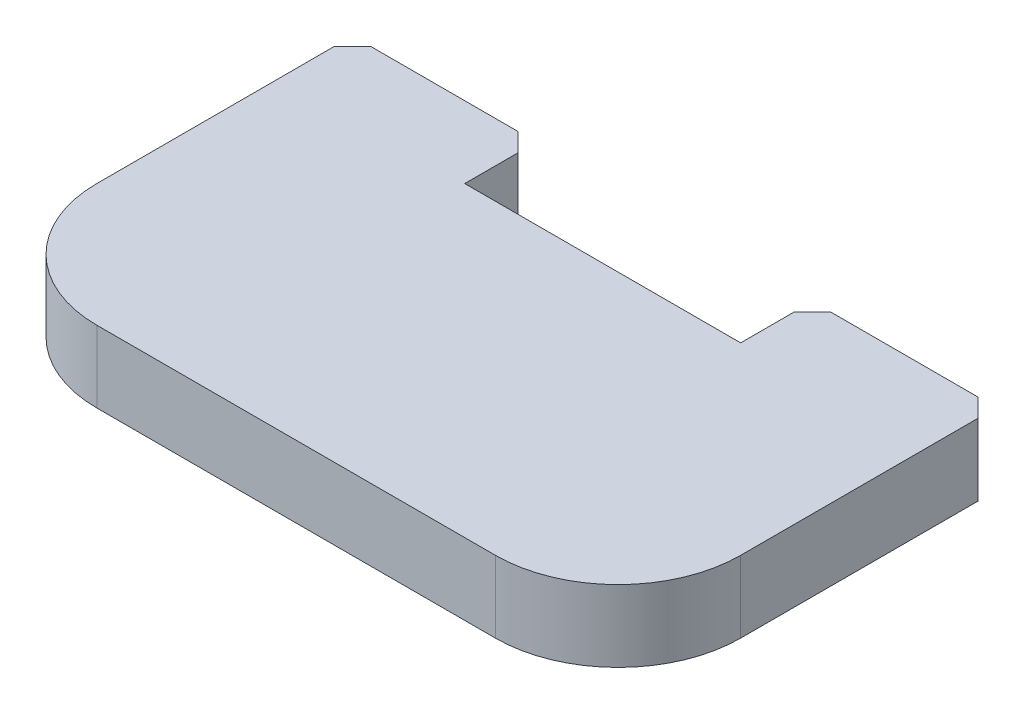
from build123d import *

# Parameters (mm, degrees)
SKETCH1_W           = 26.67
SKETCH1_H           = 15.6718
BOSS_EXTRUDE1_DEPTH = 2.9718
SKETCH2_W           = 11.43
SKETCH2_H           = 5.9436
CUT_EXTRUDE1_DEPTH  = 16.749766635
CHAMFER1_SIZE       = 0.762
FILLET1_R           = 5.08


with BuildPart() as part:
    # Sketch1 → Boss-Extrude1 (new body)
    with BuildSketch(Plane(origin=(0, 0, 0), x_dir=(1, 0, 0), z_dir=(0, 1, 0))):
        Rectangle(SKETCH1_W, SKETCH1_H)
    extrude(amount=BOSS_EXTRUDE1_DEPTH)

    # Sketch2 → Cut-Extrude1 (cut, through all)
    with BuildSketch(Plane(origin=(0, 2.9718, 0), x_dir=(1, 0, 0), z_dir=(0, 1, 0))):
        with Locations((0, 7.8359)):
            Rectangle(SKETCH2_W, SKETCH2_H)
    extrude(amount=-CUT_EXTRUDE1_DEPTH, mode=Mode.SUBTRACT)

    # Chamfer1
    chamfer1_edges = [part.edges().sort_by_distance(p)[0] for p in [
        (5.715, 1.4859, -7.8359),
        (-5.715, 1.4859, -7.8359),
        (-13.335, 1.4859, -7.8359),
        (13.335, 1.4859, -7.8359),
    ]]
    chamfer(chamfer1_edges, length=CHAMFER1_SIZE)

    # Fillet1
    fillet1_edges = [part.edges().sort_by_distance(p)[0] for p in [
        (13.335, 1.4859, 7.8359),
        (-13.335, 1.4859, 7.8359),
    ]]
    fillet(fillet1_edges, radius=FILLET1_R)


solid = part.part
